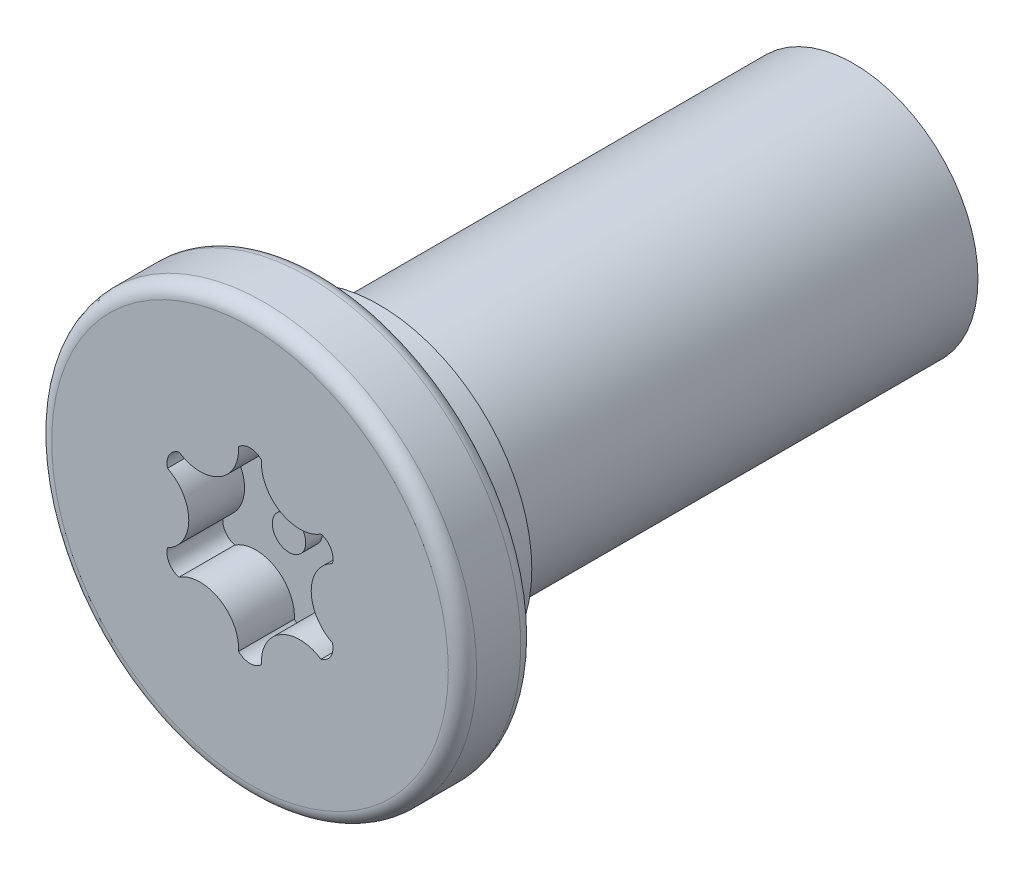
ISO-10303-21;
HEADER;
FILE_DESCRIPTION(('STEP AP214'),'2;1');
FILE_NAME('part.step','',(''),(''),'','','');
FILE_SCHEMA(('AUTOMOTIVE_DESIGN { 1 0 10303 214 1 1 1 1 }'));
ENDSEC;
DATA;
#1=APPLICATION_CONTEXT('core data for automotive mechanical design processes');
#2=APPLICATION_PROTOCOL_DEFINITION('international standard','automotive_design',2000,#1);
#3=PRODUCT_CONTEXT('',#1,'mechanical');
#4=PRODUCT('Part','Part','',(#3));
#5=PRODUCT_RELATED_PRODUCT_CATEGORY('part','',(#4));
#6=PRODUCT_DEFINITION_FORMATION('','',#4);
#7=PRODUCT_DEFINITION_CONTEXT('part definition',#1,'design');
#8=PRODUCT_DEFINITION('design','',#6,#7);
#9=PRODUCT_DEFINITION_SHAPE('','',#8);
#10=(LENGTH_UNIT() NAMED_UNIT(*) SI_UNIT(.MILLI.,.METRE.));
#11=(NAMED_UNIT(*) PLANE_ANGLE_UNIT() SI_UNIT($,.RADIAN.));
#12=(NAMED_UNIT(*) SI_UNIT($,.STERADIAN.) SOLID_ANGLE_UNIT());
#13=UNCERTAINTY_MEASURE_WITH_UNIT(LENGTH_MEASURE(1.E-05),#10,'distance_accuracy_value','');
#14=(GEOMETRIC_REPRESENTATION_CONTEXT(3) GLOBAL_UNCERTAINTY_ASSIGNED_CONTEXT((#13)) GLOBAL_UNIT_ASSIGNED_CONTEXT((#10,
#11,#12)) REPRESENTATION_CONTEXT('',''));
#15=CARTESIAN_POINT('',(0.,0.,0.));
#16=DIRECTION('',(0.,0.,1.));
#17=DIRECTION('',(1.,0.,0.));
#18=AXIS2_PLACEMENT_3D('',#15,#16,#17);
#19=CARTESIAN_POINT('',(0.,0.,0.));
#20=DIRECTION('',(0.,0.,1.));
#21=DIRECTION('',(1.,0.,0.));
#22=AXIS2_PLACEMENT_3D('',#19,#20,#21);
#23=PLANE('',#22);
#24=CARTESIAN_POINT('',(0.,0.,0.));
#25=DIRECTION('',(0.,0.,1.));
#26=DIRECTION('',(1.,0.,0.));
#27=AXIS2_PLACEMENT_3D('',#24,#25,#26);
#28=CIRCLE('',#27,3.55599999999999);
#29=CARTESIAN_POINT('',(3.55599999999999,0.,0.));
#30=VERTEX_POINT('',#29);
#31=EDGE_CURVE('E54',#30,#30,#28,.T.);
#32=ORIENTED_EDGE('',*,*,#31,.T.);
#33=EDGE_LOOP('',(#32));
#34=FACE_BOUND('',#33,.T.);
#35=CARTESIAN_POINT('',(0.893828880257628,1.54815703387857,0.));
#36=DIRECTION('',(0.,0.,1.));
#37=DIRECTION('',(1.,0.,0.));
#38=AXIS2_PLACEMENT_3D('',#35,#36,#37);
#39=CIRCLE('',#38,0.69);
#40=CARTESIAN_POINT('',(0.205060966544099,1.58937306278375,0.));
#41=VERTEX_POINT('',#40);
#42=CARTESIAN_POINT('',(1.27390696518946,0.972274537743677,0.));
#43=VERTEX_POINT('',#42);
#44=EDGE_CURVE('E181',#41,#43,#39,.T.);
#45=ORIENTED_EDGE('',*,*,#44,.T.);
#46=CARTESIAN_POINT('',(1.19884944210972,0.692156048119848,0.));
#47=DIRECTION('',(0.,0.,1.));
#48=DIRECTION('',(1.,0.,0.));
#49=AXIS2_PLACEMENT_3D('',#46,#47,#48);
#50=CIRCLE('',#49,0.29);
#51=CARTESIAN_POINT('',(1.47896793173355,0.617098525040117,0.));
#52=VERTEX_POINT('',#51);
#53=EDGE_CURVE('E61',#43,#52,#50,.F.);
#54=ORIENTED_EDGE('',*,*,#53,.T.);
#55=CARTESIAN_POINT('',(1.78765776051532,0.,0.));
#56=DIRECTION('',(0.,0.,1.));
#57=DIRECTION('',(1.,0.,0.));
#58=AXIS2_PLACEMENT_3D('',#55,#56,#57);
#59=CIRCLE('',#58,0.69);
#60=CARTESIAN_POINT('',(1.47896793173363,-0.617098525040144,0.));
#61=VERTEX_POINT('',#60);
#62=EDGE_CURVE('E111',#52,#61,#59,.T.);
#63=ORIENTED_EDGE('',*,*,#62,.T.);
#64=CARTESIAN_POINT('',(1.1988494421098,-0.692156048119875,0.));
#65=DIRECTION('',(0.,0.,1.));
#66=DIRECTION('',(1.,0.,0.));
#67=AXIS2_PLACEMENT_3D('',#64,#65,#66);
#68=CIRCLE('',#67,0.29);
#69=CARTESIAN_POINT('',(1.27390696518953,-0.972274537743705,0.));
#70=VERTEX_POINT('',#69);
#71=EDGE_CURVE('E216',#61,#70,#68,.F.);
#72=ORIENTED_EDGE('',*,*,#71,.T.);
#73=CARTESIAN_POINT('',(0.893828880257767,-1.54815703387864,0.));
#74=DIRECTION('',(0.,0.,1.));
#75=DIRECTION('',(1.,0.,0.));
#76=AXIS2_PLACEMENT_3D('',#73,#74,#75);
#77=CIRCLE('',#76,0.69);
#78=CARTESIAN_POINT('',(0.205060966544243,-1.5893730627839,0.));
#79=VERTEX_POINT('',#78);
#80=EDGE_CURVE('E160',#70,#79,#77,.T.);
#81=ORIENTED_EDGE('',*,*,#80,.T.);
#82=CARTESIAN_POINT('',(1.43067375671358E-13,-1.3843120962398,0.));
#83=DIRECTION('',(0.,0.,1.));
#84=DIRECTION('',(1.,0.,0.));
#85=AXIS2_PLACEMENT_3D('',#82,#83,#84);
#86=CIRCLE('',#85,0.29);
#87=CARTESIAN_POINT('',(-0.205060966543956,-1.5893730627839,0.));
#88=VERTEX_POINT('',#87);
#89=EDGE_CURVE('E210',#79,#88,#86,.F.);
#90=ORIENTED_EDGE('',*,*,#89,.T.);
#91=CARTESIAN_POINT('',(-0.893828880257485,-1.54815703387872,0.));
#92=DIRECTION('',(0.,0.,1.));
#93=DIRECTION('',(1.,0.,0.));
#94=AXIS2_PLACEMENT_3D('',#91,#92,#93);
#95=CIRCLE('',#94,0.69);
#96=CARTESIAN_POINT('',(-1.27390696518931,-0.97227453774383,0.));
#97=VERTEX_POINT('',#96);
#98=EDGE_CURVE('E206',#88,#97,#95,.T.);
#99=ORIENTED_EDGE('',*,*,#98,.T.);
#100=CARTESIAN_POINT('',(-1.19884944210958,-0.69215604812,0.));
#101=DIRECTION('',(0.,0.,1.));
#102=DIRECTION('',(1.,0.,0.));
#103=AXIS2_PLACEMENT_3D('',#100,#101,#102);
#104=CIRCLE('',#103,0.29);
#105=CARTESIAN_POINT('',(-1.47896793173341,-0.617098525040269,0.));
#106=VERTEX_POINT('',#105);
#107=EDGE_CURVE('E202',#97,#106,#104,.F.);
#108=ORIENTED_EDGE('',*,*,#107,.T.);
#109=CARTESIAN_POINT('',(-1.78765776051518,-1.56674837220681E-13,0.));
#110=DIRECTION('',(0.,0.,1.));
#111=DIRECTION('',(1.,0.,0.));
#112=AXIS2_PLACEMENT_3D('',#109,#110,#111);
#113=CIRCLE('',#112,0.69);
#114=CARTESIAN_POINT('',(-1.47896793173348,0.617098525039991,0.));
#115=VERTEX_POINT('',#114);
#116=EDGE_CURVE('E198',#106,#115,#113,.T.);
#117=ORIENTED_EDGE('',*,*,#116,.T.);
#118=CARTESIAN_POINT('',(-1.19884944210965,0.692156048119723,0.));
#119=DIRECTION('',(0.,0.,1.));
#120=DIRECTION('',(1.,0.,0.));
#121=AXIS2_PLACEMENT_3D('',#118,#119,#120);
#122=CIRCLE('',#121,0.29);
#123=CARTESIAN_POINT('',(-1.27390696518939,0.972274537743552,0.));
#124=VERTEX_POINT('',#123);
#125=EDGE_CURVE('E194',#115,#124,#122,.F.);
#126=ORIENTED_EDGE('',*,*,#125,.T.);
#127=CARTESIAN_POINT('',(-0.893828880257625,1.54815703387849,0.));
#128=DIRECTION('',(0.,0.,1.));
#129=DIRECTION('',(1.,0.,0.));
#130=AXIS2_PLACEMENT_3D('',#127,#128,#129);
#131=CIRCLE('',#130,0.690000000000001);
#132=CARTESIAN_POINT('',(-0.205060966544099,1.58937306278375,0.));
#133=VERTEX_POINT('',#132);
#134=EDGE_CURVE('E190',#124,#133,#131,.T.);
#135=ORIENTED_EDGE('',*,*,#134,.T.);
#136=CARTESIAN_POINT('',(0.,1.38431209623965,0.));
#137=DIRECTION('',(0.,0.,1.));
#138=DIRECTION('',(1.,0.,0.));
#139=AXIS2_PLACEMENT_3D('',#136,#137,#138);
#140=CIRCLE('',#139,0.29);
#141=EDGE_CURVE('E186',#133,#41,#140,.F.);
#142=ORIENTED_EDGE('',*,*,#141,.T.);
#143=EDGE_LOOP('',(#45,#54,#63,#72,#81,#90,#99,#108,#117,#126,#135,#142));
#144=FACE_BOUND('',#143,.T.);
#145=ADVANCED_FACE('F45',(#34,#144),#23,.T.);
#146=CARTESIAN_POINT('',(0.,0.,-1.3));
#147=DIRECTION('',(0.,0.,1.));
#148=DIRECTION('',(1.,0.,0.));
#149=AXIS2_PLACEMENT_3D('',#146,#147,#148);
#150=PLANE('',#149);
#151=CARTESIAN_POINT('',(0.,0.,-1.3));
#152=DIRECTION('',(0.,0.,1.));
#153=DIRECTION('',(1.,0.,0.));
#154=AXIS2_PLACEMENT_3D('',#151,#152,#153);
#155=CIRCLE('',#154,2.738000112);
#156=CARTESIAN_POINT('',(2.738000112,0.,-1.3));
#157=VERTEX_POINT('',#156);
#158=EDGE_CURVE('E11',#157,#157,#155,.F.);
#159=ORIENTED_EDGE('',*,*,#158,.F.);
#160=EDGE_LOOP('',(#159));
#161=FACE_BOUND('',#160,.T.);
#162=CARTESIAN_POINT('',(0.,0.,-1.3));
#163=DIRECTION('',(0.,0.,1.));
#164=DIRECTION('',(1.,0.,0.));
#165=AXIS2_PLACEMENT_3D('',#162,#163,#164);
#166=CIRCLE('',#165,3.55599999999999);
#167=CARTESIAN_POINT('',(3.55599999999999,0.,-1.3));
#168=VERTEX_POINT('',#167);
#169=EDGE_CURVE('E260',#168,#168,#166,.F.);
#170=ORIENTED_EDGE('',*,*,#169,.T.);
#171=EDGE_LOOP('',(#170));
#172=FACE_BOUND('',#171,.T.);
#173=ADVANCED_FACE('F283',(#161,#172),#150,.F.);
#174=CARTESIAN_POINT('',(0.,0.,-1.3));
#175=DIRECTION('',(0.,0.,1.));
#176=DIRECTION('',(1.,0.,0.));
#177=AXIS2_PLACEMENT_3D('',#174,#175,#176);
#178=CYLINDRICAL_SURFACE('',#177,3.80999999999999);
#179=CARTESIAN_POINT('',(0.,0.,-1.046));
#180=DIRECTION('',(0.,0.,1.));
#181=DIRECTION('',(1.,0.,0.));
#182=AXIS2_PLACEMENT_3D('',#179,#180,#181);
#183=CIRCLE('',#182,3.80999999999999);
#184=CARTESIAN_POINT('',(3.80999999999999,0.,-1.046));
#185=VERTEX_POINT('',#184);
#186=EDGE_CURVE('E256',#185,#185,#183,.T.);
#187=ORIENTED_EDGE('',*,*,#186,.T.);
#188=EDGE_LOOP('',(#187));
#189=FACE_BOUND('',#188,.T.);
#190=CARTESIAN_POINT('',(0.,0.,-0.254));
#191=DIRECTION('',(0.,0.,1.));
#192=DIRECTION('',(1.,0.,0.));
#193=AXIS2_PLACEMENT_3D('',#190,#191,#192);
#194=CIRCLE('',#193,3.80999999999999);
#195=CARTESIAN_POINT('',(3.80999999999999,0.,-0.254));
#196=VERTEX_POINT('',#195);
#197=EDGE_CURVE('E225',#196,#196,#194,.F.);
#198=ORIENTED_EDGE('',*,*,#197,.T.);
#199=EDGE_LOOP('',(#198));
#200=FACE_BOUND('',#199,.T.);
#201=ADVANCED_FACE('F289',(#189,#200),#178,.T.);
#202=CARTESIAN_POINT('',(1.19884944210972,0.692156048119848,-1.));
#203=DIRECTION('',(0.,0.,1.));
#204=DIRECTION('',(1.,0.,0.));
#205=AXIS2_PLACEMENT_3D('',#202,#203,#204);
#206=CYLINDRICAL_SURFACE('',#205,0.29);
#207=ORIENTED_EDGE('',*,*,#53,.F.);
#208=DIRECTION('',(0.,0.,1.));
#209=VECTOR('',#208,1.);
#210=CARTESIAN_POINT('',(1.27390696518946,0.972274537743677,-1.));
#211=LINE('',#210,#209);
#212=CARTESIAN_POINT('',(1.27390696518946,0.972274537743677,-1.));
#213=VERTEX_POINT('',#212);
#214=EDGE_CURVE('E178',#213,#43,#211,.T.);
#215=ORIENTED_EDGE('',*,*,#214,.F.);
#216=CARTESIAN_POINT('',(1.19884944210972,0.692156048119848,-1.));
#217=DIRECTION('',(0.,0.,1.));
#218=DIRECTION('',(1.,0.,0.));
#219=AXIS2_PLACEMENT_3D('',#216,#217,#218);
#220=CIRCLE('',#219,0.29);
#221=CARTESIAN_POINT('',(1.47896793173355,0.617098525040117,-1.));
#222=VERTEX_POINT('',#221);
#223=EDGE_CURVE('E221',#213,#222,#220,.F.);
#224=ORIENTED_EDGE('',*,*,#223,.T.);
#225=DIRECTION('',(0.,0.,1.));
#226=VECTOR('',#225,1.);
#227=CARTESIAN_POINT('',(1.47896793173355,0.617098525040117,-1.));
#228=LINE('',#227,#226);
#229=EDGE_CURVE('E222',#222,#52,#228,.T.);
#230=ORIENTED_EDGE('',*,*,#229,.T.);
#231=EDGE_LOOP('',(#207,#215,#224,#230));
#232=FACE_BOUND('',#231,.T.);
#233=ADVANCED_FACE('F294',(#232),#206,.F.);
#234=CARTESIAN_POINT('',(1.78765776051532,0.,-1.));
#235=DIRECTION('',(0.,0.,1.));
#236=DIRECTION('',(1.,0.,0.));
#237=AXIS2_PLACEMENT_3D('',#234,#235,#236);
#238=CYLINDRICAL_SURFACE('',#237,0.69);
#239=ORIENTED_EDGE('',*,*,#62,.F.);
#240=ORIENTED_EDGE('',*,*,#229,.F.);
#241=CARTESIAN_POINT('',(1.78765776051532,0.,-1.));
#242=DIRECTION('',(0.,0.,1.));
#243=DIRECTION('',(1.,0.,0.));
#244=AXIS2_PLACEMENT_3D('',#241,#242,#243);
#245=CIRCLE('',#244,0.69);
#246=CARTESIAN_POINT('',(1.47896793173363,-0.617098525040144,-1.));
#247=VERTEX_POINT('',#246);
#248=EDGE_CURVE('E70',#222,#247,#245,.T.);
#249=ORIENTED_EDGE('',*,*,#248,.T.);
#250=DIRECTION('',(0.,0.,1.));
#251=VECTOR('',#250,1.);
#252=CARTESIAN_POINT('',(1.47896793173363,-0.617098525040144,-1.));
#253=LINE('',#252,#251);
#254=EDGE_CURVE('E151',#247,#61,#253,.T.);
#255=ORIENTED_EDGE('',*,*,#254,.T.);
#256=EDGE_LOOP('',(#239,#240,#249,#255));
#257=FACE_BOUND('',#256,.T.);
#258=ADVANCED_FACE('F301',(#257),#238,.T.);
#259=CARTESIAN_POINT('',(1.1988494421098,-0.692156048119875,-1.));
#260=DIRECTION('',(0.,0.,1.));
#261=DIRECTION('',(1.,0.,0.));
#262=AXIS2_PLACEMENT_3D('',#259,#260,#261);
#263=CYLINDRICAL_SURFACE('',#262,0.29);
#264=ORIENTED_EDGE('',*,*,#71,.F.);
#265=ORIENTED_EDGE('',*,*,#254,.F.);
#266=CARTESIAN_POINT('',(1.1988494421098,-0.692156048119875,-1.));
#267=DIRECTION('',(0.,0.,1.));
#268=DIRECTION('',(1.,0.,0.));
#269=AXIS2_PLACEMENT_3D('',#266,#267,#268);
#270=CIRCLE('',#269,0.29);
#271=CARTESIAN_POINT('',(1.27390696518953,-0.972274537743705,-1.));
#272=VERTEX_POINT('',#271);
#273=EDGE_CURVE('E145',#247,#272,#270,.F.);
#274=ORIENTED_EDGE('',*,*,#273,.T.);
#275=DIRECTION('',(0.,0.,1.));
#276=VECTOR('',#275,1.);
#277=CARTESIAN_POINT('',(1.27390696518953,-0.972274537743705,-1.));
#278=LINE('',#277,#276);
#279=EDGE_CURVE('E149',#272,#70,#278,.T.);
#280=ORIENTED_EDGE('',*,*,#279,.T.);
#281=EDGE_LOOP('',(#264,#265,#274,#280));
#282=FACE_BOUND('',#281,.T.);
#283=ADVANCED_FACE('F148',(#282),#263,.F.);
#284=CARTESIAN_POINT('',(0.893828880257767,-1.54815703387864,-1.));
#285=DIRECTION('',(0.,0.,1.));
#286=DIRECTION('',(1.,0.,0.));
#287=AXIS2_PLACEMENT_3D('',#284,#285,#286);
#288=CYLINDRICAL_SURFACE('',#287,0.69);
#289=ORIENTED_EDGE('',*,*,#80,.F.);
#290=ORIENTED_EDGE('',*,*,#279,.F.);
#291=CARTESIAN_POINT('',(0.893828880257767,-1.54815703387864,-1.));
#292=DIRECTION('',(0.,0.,1.));
#293=DIRECTION('',(1.,0.,0.));
#294=AXIS2_PLACEMENT_3D('',#291,#292,#293);
#295=CIRCLE('',#294,0.69);
#296=CARTESIAN_POINT('',(0.205060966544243,-1.5893730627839,-1.));
#297=VERTEX_POINT('',#296);
#298=EDGE_CURVE('E154',#272,#297,#295,.T.);
#299=ORIENTED_EDGE('',*,*,#298,.T.);
#300=DIRECTION('',(0.,0.,1.));
#301=VECTOR('',#300,1.);
#302=CARTESIAN_POINT('',(0.205060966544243,-1.5893730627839,-1.));
#303=LINE('',#302,#301);
#304=EDGE_CURVE('E163',#297,#79,#303,.T.);
#305=ORIENTED_EDGE('',*,*,#304,.T.);
#306=EDGE_LOOP('',(#289,#290,#299,#305));
#307=FACE_BOUND('',#306,.T.);
#308=ADVANCED_FACE('F157',(#307),#288,.T.);
#309=CARTESIAN_POINT('',(1.43067375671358E-13,-1.3843120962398,-1.));
#310=DIRECTION('',(0.,0.,1.));
#311=DIRECTION('',(1.,0.,0.));
#312=AXIS2_PLACEMENT_3D('',#309,#310,#311);
#313=CYLINDRICAL_SURFACE('',#312,0.29);
#314=ORIENTED_EDGE('',*,*,#89,.F.);
#315=ORIENTED_EDGE('',*,*,#304,.F.);
#316=CARTESIAN_POINT('',(1.43067375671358E-13,-1.3843120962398,-1.));
#317=DIRECTION('',(0.,0.,1.));
#318=DIRECTION('',(1.,0.,0.));
#319=AXIS2_PLACEMENT_3D('',#316,#317,#318);
#320=CIRCLE('',#319,0.29);
#321=CARTESIAN_POINT('',(-0.205060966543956,-1.5893730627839,-1.));
#322=VERTEX_POINT('',#321);
#323=EDGE_CURVE('E168',#297,#322,#320,.F.);
#324=ORIENTED_EDGE('',*,*,#323,.T.);
#325=DIRECTION('',(0.,0.,1.));
#326=VECTOR('',#325,1.);
#327=CARTESIAN_POINT('',(-0.205060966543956,-1.5893730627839,-1.));
#328=LINE('',#327,#326);
#329=EDGE_CURVE('E230',#322,#88,#328,.T.);
#330=ORIENTED_EDGE('',*,*,#329,.T.);
#331=EDGE_LOOP('',(#314,#315,#324,#330));
#332=FACE_BOUND('',#331,.T.);
#333=ADVANCED_FACE('F318',(#332),#313,.F.);
#334=CARTESIAN_POINT('',(-0.893828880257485,-1.54815703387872,-1.));
#335=DIRECTION('',(0.,0.,1.));
#336=DIRECTION('',(1.,0.,0.));
#337=AXIS2_PLACEMENT_3D('',#334,#335,#336);
#338=CYLINDRICAL_SURFACE('',#337,0.69);
#339=ORIENTED_EDGE('',*,*,#98,.F.);
#340=ORIENTED_EDGE('',*,*,#329,.F.);
#341=CARTESIAN_POINT('',(-0.893828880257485,-1.54815703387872,-1.));
#342=DIRECTION('',(0.,0.,1.));
#343=DIRECTION('',(1.,0.,0.));
#344=AXIS2_PLACEMENT_3D('',#341,#342,#343);
#345=CIRCLE('',#344,0.69);
#346=CARTESIAN_POINT('',(-1.27390696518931,-0.97227453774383,-1.));
#347=VERTEX_POINT('',#346);
#348=EDGE_CURVE('E172',#322,#347,#345,.T.);
#349=ORIENTED_EDGE('',*,*,#348,.T.);
#350=DIRECTION('',(0.,0.,1.));
#351=VECTOR('',#350,1.);
#352=CARTESIAN_POINT('',(-1.27390696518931,-0.97227453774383,-1.));
#353=LINE('',#352,#351);
#354=EDGE_CURVE('E233',#347,#97,#353,.T.);
#355=ORIENTED_EDGE('',*,*,#354,.T.);
#356=EDGE_LOOP('',(#339,#340,#349,#355));
#357=FACE_BOUND('',#356,.T.);
#358=ADVANCED_FACE('F321',(#357),#338,.T.);
#359=CARTESIAN_POINT('',(-1.19884944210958,-0.69215604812,-1.));
#360=DIRECTION('',(0.,0.,1.));
#361=DIRECTION('',(1.,0.,0.));
#362=AXIS2_PLACEMENT_3D('',#359,#360,#361);
#363=CYLINDRICAL_SURFACE('',#362,0.29);
#364=ORIENTED_EDGE('',*,*,#107,.F.);
#365=ORIENTED_EDGE('',*,*,#354,.F.);
#366=CARTESIAN_POINT('',(-1.19884944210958,-0.69215604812,-1.));
#367=DIRECTION('',(0.,0.,1.));
#368=DIRECTION('',(1.,0.,0.));
#369=AXIS2_PLACEMENT_3D('',#366,#367,#368);
#370=CIRCLE('',#369,0.29);
#371=CARTESIAN_POINT('',(-1.47896793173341,-0.617098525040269,-1.));
#372=VERTEX_POINT('',#371);
#373=EDGE_CURVE('E374',#347,#372,#370,.F.);
#374=ORIENTED_EDGE('',*,*,#373,.T.);
#375=DIRECTION('',(0.,0.,1.));
#376=VECTOR('',#375,1.);
#377=CARTESIAN_POINT('',(-1.47896793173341,-0.617098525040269,-1.));
#378=LINE('',#377,#376);
#379=EDGE_CURVE('E236',#372,#106,#378,.T.);
#380=ORIENTED_EDGE('',*,*,#379,.T.);
#381=EDGE_LOOP('',(#364,#365,#374,#380));
#382=FACE_BOUND('',#381,.T.);
#383=ADVANCED_FACE('F325',(#382),#363,.F.);
#384=CARTESIAN_POINT('',(-1.78765776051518,-1.56674837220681E-13,-1.));
#385=DIRECTION('',(0.,0.,1.));
#386=DIRECTION('',(1.,0.,0.));
#387=AXIS2_PLACEMENT_3D('',#384,#385,#386);
#388=CYLINDRICAL_SURFACE('',#387,0.69);
#389=ORIENTED_EDGE('',*,*,#116,.F.);
#390=ORIENTED_EDGE('',*,*,#379,.F.);
#391=CARTESIAN_POINT('',(-1.78765776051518,-1.56674837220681E-13,-1.));
#392=DIRECTION('',(0.,0.,1.));
#393=DIRECTION('',(1.,0.,0.));
#394=AXIS2_PLACEMENT_3D('',#391,#392,#393);
#395=CIRCLE('',#394,0.69);
#396=CARTESIAN_POINT('',(-1.47896793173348,0.617098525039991,-1.));
#397=VERTEX_POINT('',#396);
#398=EDGE_CURVE('E371',#372,#397,#395,.T.);
#399=ORIENTED_EDGE('',*,*,#398,.T.);
#400=DIRECTION('',(0.,0.,1.));
#401=VECTOR('',#400,1.);
#402=CARTESIAN_POINT('',(-1.47896793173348,0.617098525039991,-1.));
#403=LINE('',#402,#401);
#404=EDGE_CURVE('E239',#397,#115,#403,.T.);
#405=ORIENTED_EDGE('',*,*,#404,.T.);
#406=EDGE_LOOP('',(#389,#390,#399,#405));
#407=FACE_BOUND('',#406,.T.);
#408=ADVANCED_FACE('F329',(#407),#388,.T.);
#409=CARTESIAN_POINT('',(-1.19884944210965,0.692156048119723,-1.));
#410=DIRECTION('',(0.,0.,1.));
#411=DIRECTION('',(1.,0.,0.));
#412=AXIS2_PLACEMENT_3D('',#409,#410,#411);
#413=CYLINDRICAL_SURFACE('',#412,0.29);
#414=ORIENTED_EDGE('',*,*,#125,.F.);
#415=ORIENTED_EDGE('',*,*,#404,.F.);
#416=CARTESIAN_POINT('',(-1.19884944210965,0.692156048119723,-1.));
#417=DIRECTION('',(0.,0.,1.));
#418=DIRECTION('',(1.,0.,0.));
#419=AXIS2_PLACEMENT_3D('',#416,#417,#418);
#420=CIRCLE('',#419,0.29);
#421=CARTESIAN_POINT('',(-1.27390696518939,0.972274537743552,-1.));
#422=VERTEX_POINT('',#421);
#423=EDGE_CURVE('E364',#397,#422,#420,.F.);
#424=ORIENTED_EDGE('',*,*,#423,.T.);
#425=DIRECTION('',(0.,0.,1.));
#426=VECTOR('',#425,1.);
#427=CARTESIAN_POINT('',(-1.27390696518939,0.972274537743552,-1.));
#428=LINE('',#427,#426);
#429=EDGE_CURVE('E242',#422,#124,#428,.T.);
#430=ORIENTED_EDGE('',*,*,#429,.T.);
#431=EDGE_LOOP('',(#414,#415,#424,#430));
#432=FACE_BOUND('',#431,.T.);
#433=ADVANCED_FACE('F333',(#432),#413,.F.);
#434=CARTESIAN_POINT('',(-0.893828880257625,1.54815703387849,-1.));
#435=DIRECTION('',(0.,0.,1.));
#436=DIRECTION('',(1.,0.,0.));
#437=AXIS2_PLACEMENT_3D('',#434,#435,#436);
#438=CYLINDRICAL_SURFACE('',#437,0.690000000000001);
#439=ORIENTED_EDGE('',*,*,#134,.F.);
#440=ORIENTED_EDGE('',*,*,#429,.F.);
#441=CARTESIAN_POINT('',(-0.893828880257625,1.54815703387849,-1.));
#442=DIRECTION('',(0.,0.,1.));
#443=DIRECTION('',(1.,0.,0.));
#444=AXIS2_PLACEMENT_3D('',#441,#442,#443);
#445=CIRCLE('',#444,0.690000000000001);
#446=CARTESIAN_POINT('',(-0.205060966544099,1.58937306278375,-1.));
#447=VERTEX_POINT('',#446);
#448=EDGE_CURVE('E360',#422,#447,#445,.T.);
#449=ORIENTED_EDGE('',*,*,#448,.T.);
#450=DIRECTION('',(0.,0.,1.));
#451=VECTOR('',#450,1.);
#452=CARTESIAN_POINT('',(-0.205060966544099,1.58937306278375,-1.));
#453=LINE('',#452,#451);
#454=EDGE_CURVE('E245',#447,#133,#453,.T.);
#455=ORIENTED_EDGE('',*,*,#454,.T.);
#456=EDGE_LOOP('',(#439,#440,#449,#455));
#457=FACE_BOUND('',#456,.T.);
#458=ADVANCED_FACE('F337',(#457),#438,.T.);
#459=CARTESIAN_POINT('',(0.,1.38431209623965,-1.));
#460=DIRECTION('',(0.,0.,1.));
#461=DIRECTION('',(1.,0.,0.));
#462=AXIS2_PLACEMENT_3D('',#459,#460,#461);
#463=CYLINDRICAL_SURFACE('',#462,0.29);
#464=ORIENTED_EDGE('',*,*,#141,.F.);
#465=ORIENTED_EDGE('',*,*,#454,.F.);
#466=CARTESIAN_POINT('',(0.,1.38431209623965,-1.));
#467=DIRECTION('',(0.,0.,1.));
#468=DIRECTION('',(1.,0.,0.));
#469=AXIS2_PLACEMENT_3D('',#466,#467,#468);
#470=CIRCLE('',#469,0.29);
#471=CARTESIAN_POINT('',(0.205060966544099,1.58937306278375,-1.));
#472=VERTEX_POINT('',#471);
#473=EDGE_CURVE('E357',#447,#472,#470,.F.);
#474=ORIENTED_EDGE('',*,*,#473,.T.);
#475=DIRECTION('',(0.,0.,1.));
#476=VECTOR('',#475,1.);
#477=CARTESIAN_POINT('',(0.205060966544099,1.58937306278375,-1.));
#478=LINE('',#477,#476);
#479=EDGE_CURVE('E248',#472,#41,#478,.T.);
#480=ORIENTED_EDGE('',*,*,#479,.T.);
#481=EDGE_LOOP('',(#464,#465,#474,#480));
#482=FACE_BOUND('',#481,.T.);
#483=ADVANCED_FACE('F341',(#482),#463,.F.);
#484=CARTESIAN_POINT('',(0.893828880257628,1.54815703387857,-1.));
#485=DIRECTION('',(0.,0.,1.));
#486=DIRECTION('',(1.,0.,0.));
#487=AXIS2_PLACEMENT_3D('',#484,#485,#486);
#488=CYLINDRICAL_SURFACE('',#487,0.69);
#489=ORIENTED_EDGE('',*,*,#44,.F.);
#490=ORIENTED_EDGE('',*,*,#479,.F.);
#491=CARTESIAN_POINT('',(0.893828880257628,1.54815703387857,-1.));
#492=DIRECTION('',(0.,0.,1.));
#493=DIRECTION('',(1.,0.,0.));
#494=AXIS2_PLACEMENT_3D('',#491,#492,#493);
#495=CIRCLE('',#494,0.69);
#496=EDGE_CURVE('E118',#472,#213,#495,.T.);
#497=ORIENTED_EDGE('',*,*,#496,.T.);
#498=ORIENTED_EDGE('',*,*,#214,.T.);
#499=EDGE_LOOP('',(#489,#490,#497,#498));
#500=FACE_BOUND('',#499,.T.);
#501=ADVANCED_FACE('F344',(#500),#488,.T.);
#502=CARTESIAN_POINT('',(0.,0.,-1.));
#503=DIRECTION('',(0.,0.,1.));
#504=DIRECTION('',(1.,0.,0.));
#505=AXIS2_PLACEMENT_3D('',#502,#503,#504);
#506=PLANE('',#505);
#507=CARTESIAN_POINT('',(0.,0.,-1.));
#508=DIRECTION('',(0.,0.,1.));
#509=DIRECTION('',(1.,0.,0.));
#510=AXIS2_PLACEMENT_3D('',#507,#508,#509);
#511=CIRCLE('',#510,0.3);
#512=CARTESIAN_POINT('',(0.3,0.,-1.));
#513=VERTEX_POINT('',#512);
#514=EDGE_CURVE('E396',#513,#513,#511,.T.);
#515=ORIENTED_EDGE('',*,*,#514,.F.);
#516=EDGE_LOOP('',(#515));
#517=FACE_BOUND('',#516,.T.);
#518=ORIENTED_EDGE('',*,*,#223,.F.);
#519=ORIENTED_EDGE('',*,*,#496,.F.);
#520=ORIENTED_EDGE('',*,*,#473,.F.);
#521=ORIENTED_EDGE('',*,*,#448,.F.);
#522=ORIENTED_EDGE('',*,*,#423,.F.);
#523=ORIENTED_EDGE('',*,*,#398,.F.);
#524=ORIENTED_EDGE('',*,*,#373,.F.);
#525=ORIENTED_EDGE('',*,*,#348,.F.);
#526=ORIENTED_EDGE('',*,*,#323,.F.);
#527=ORIENTED_EDGE('',*,*,#298,.F.);
#528=ORIENTED_EDGE('',*,*,#273,.F.);
#529=ORIENTED_EDGE('',*,*,#248,.F.);
#530=EDGE_LOOP('',(#518,#519,#520,#521,#522,#523,#524,#525,#526,#527,#528,#529));
#531=FACE_BOUND('',#530,.T.);
#532=ADVANCED_FACE('F166',(#517,#531),#506,.T.);
#533=CARTESIAN_POINT('',(0.,0.,-1.046));
#534=DIRECTION('',(0.,0.,1.));
#535=DIRECTION('',(1.,0.,0.));
#536=AXIS2_PLACEMENT_3D('',#533,#534,#535);
#537=TOROIDAL_SURFACE('',#536,3.55599999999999,0.254);
#538=ORIENTED_EDGE('',*,*,#169,.F.);
#539=EDGE_LOOP('',(#538));
#540=FACE_BOUND('',#539,.T.);
#541=ORIENTED_EDGE('',*,*,#186,.F.);
#542=EDGE_LOOP('',(#541));
#543=FACE_BOUND('',#542,.T.);
#544=ADVANCED_FACE('F271',(#540,#543),#537,.T.);
#545=CARTESIAN_POINT('',(0.,0.,-0.254));
#546=DIRECTION('',(0.,0.,1.));
#547=DIRECTION('',(1.,0.,0.));
#548=AXIS2_PLACEMENT_3D('',#545,#546,#547);
#549=TOROIDAL_SURFACE('',#548,3.55599999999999,0.254);
#550=ORIENTED_EDGE('',*,*,#197,.F.);
#551=EDGE_LOOP('',(#550));
#552=FACE_BOUND('',#551,.T.);
#553=ORIENTED_EDGE('',*,*,#31,.F.);
#554=EDGE_LOOP('',(#553));
#555=FACE_BOUND('',#554,.T.);
#556=ADVANCED_FACE('F47',(#552,#555),#549,.T.);
#557=CARTESIAN_POINT('',(0.,0.,-2.316));
#558=DIRECTION('',(0.,0.,-1.));
#559=DIRECTION('',(-1.,0.,0.));
#560=AXIS2_PLACEMENT_3D('',#557,#558,#559);
#561=PLANE('',#560);
#562=CARTESIAN_POINT('',(0.,0.,-2.316));
#563=DIRECTION('',(0.,0.,-1.));
#564=DIRECTION('',(-1.,0.,0.));
#565=AXIS2_PLACEMENT_3D('',#562,#563,#564);
#566=CIRCLE('',#565,2.738000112);
#567=CARTESIAN_POINT('',(-2.738000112,0.,-2.316));
#568=VERTEX_POINT('',#567);
#569=EDGE_CURVE('E182',#568,#568,#566,.T.);
#570=ORIENTED_EDGE('',*,*,#569,.T.);
#571=EDGE_LOOP('',(#570));
#572=FACE_BOUND('',#571,.T.);
#573=CARTESIAN_POINT('',(0.,0.,-2.316));
#574=DIRECTION('',(0.,0.,-1.));
#575=DIRECTION('',(-1.,0.,0.));
#576=AXIS2_PLACEMENT_3D('',#573,#574,#575);
#577=CIRCLE('',#576,2.230000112);
#578=CARTESIAN_POINT('',(2.230000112,0.,-2.316));
#579=VERTEX_POINT('',#578);
#580=EDGE_CURVE('E400',#579,#579,#577,.T.);
#581=ORIENTED_EDGE('',*,*,#580,.F.);
#582=EDGE_LOOP('',(#581));
#583=FACE_BOUND('',#582,.T.);
#584=ADVANCED_FACE('F270',(#572,#583),#561,.T.);
#585=CARTESIAN_POINT('',(0.,0.,-2.316));
#586=DIRECTION('',(0.,0.,1.));
#587=DIRECTION('',(1.,0.,0.));
#588=AXIS2_PLACEMENT_3D('',#585,#586,#587);
#589=CYLINDRICAL_SURFACE('',#588,2.738000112);
#590=ORIENTED_EDGE('',*,*,#569,.F.);
#591=EDGE_LOOP('',(#590));
#592=FACE_BOUND('',#591,.T.);
#593=ORIENTED_EDGE('',*,*,#158,.T.);
#594=EDGE_LOOP('',(#593));
#595=FACE_BOUND('',#594,.T.);
#596=ADVANCED_FACE('F277',(#592,#595),#589,.T.);
#597=CARTESIAN_POINT('',(0.,0.,-0.7));
#598=DIRECTION('',(0.,0.,-1.));
#599=DIRECTION('',(-1.,0.,0.));
#600=AXIS2_PLACEMENT_3D('',#597,#598,#599);
#601=CYLINDRICAL_SURFACE('',#600,0.3);
#602=CARTESIAN_POINT('',(0.,0.,-0.7));
#603=DIRECTION('',(0.,0.,1.));
#604=DIRECTION('',(1.,0.,0.));
#605=AXIS2_PLACEMENT_3D('',#602,#603,#604);
#606=CIRCLE('',#605,0.3);
#607=CARTESIAN_POINT('',(0.3,0.,-0.7));
#608=VERTEX_POINT('',#607);
#609=EDGE_CURVE('E395',#608,#608,#606,.T.);
#610=ORIENTED_EDGE('',*,*,#609,.F.);
#611=EDGE_LOOP('',(#610));
#612=FACE_BOUND('',#611,.T.);
#613=ORIENTED_EDGE('',*,*,#514,.T.);
#614=EDGE_LOOP('',(#613));
#615=FACE_BOUND('',#614,.T.);
#616=ADVANCED_FACE('F424',(#612,#615),#601,.T.);
#617=CARTESIAN_POINT('',(0.,0.,-0.7));
#618=DIRECTION('',(0.,0.,1.));
#619=DIRECTION('',(1.,0.,0.));
#620=AXIS2_PLACEMENT_3D('',#617,#618,#619);
#621=PLANE('',#620);
#622=ORIENTED_EDGE('',*,*,#609,.T.);
#623=EDGE_LOOP('',(#622));
#624=FACE_BOUND('',#623,.T.);
#625=ADVANCED_FACE('F416',(#624),#621,.T.);
#626=CARTESIAN_POINT('',(0.,0.,-10.825));
#627=DIRECTION('',(0.,0.,1.));
#628=DIRECTION('',(1.,0.,0.));
#629=AXIS2_PLACEMENT_3D('',#626,#627,#628);
#630=CYLINDRICAL_SURFACE('',#629,2.230000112);
#631=CARTESIAN_POINT('',(0.,0.,-10.825));
#632=DIRECTION('',(0.,0.,-1.));
#633=DIRECTION('',(-1.,0.,0.));
#634=AXIS2_PLACEMENT_3D('',#631,#632,#633);
#635=CIRCLE('',#634,2.230000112);
#636=CARTESIAN_POINT('',(2.230000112,0.,-10.825));
#637=VERTEX_POINT('',#636);
#638=EDGE_CURVE('E407',#637,#637,#635,.T.);
#639=CARTESIAN_POINT('',(2.230000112,0.,-2.316));
#640=CARTESIAN_POINT('',(2.230000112,0.,-2.40463541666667));
#641=CARTESIAN_POINT('',(2.230000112,0.,-2.49327083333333));
#642=CARTESIAN_POINT('',(2.230000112,0.,-2.67054166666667));
#643=CARTESIAN_POINT('',(2.230000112,0.,-2.75917708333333));
#644=CARTESIAN_POINT('',(2.230000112,0.,-2.93644791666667));
#645=CARTESIAN_POINT('',(2.230000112,0.,-3.02508333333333));
#646=CARTESIAN_POINT('',(2.230000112,0.,-3.20235416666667));
#647=CARTESIAN_POINT('',(2.230000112,0.,-3.29098958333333));
#648=CARTESIAN_POINT('',(2.230000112,0.,-3.46826041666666));
#649=CARTESIAN_POINT('',(2.230000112,0.,-3.55689583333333));
#650=CARTESIAN_POINT('',(2.230000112,0.,-3.73416666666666));
#651=CARTESIAN_POINT('',(2.230000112,0.,-3.82280208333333));
#652=CARTESIAN_POINT('',(2.230000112,0.,-4.00007291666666));
#653=CARTESIAN_POINT('',(2.230000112,0.,-4.08870833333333));
#654=CARTESIAN_POINT('',(2.230000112,0.,-4.26597916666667));
#655=CARTESIAN_POINT('',(2.230000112,0.,-4.35461458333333));
#656=CARTESIAN_POINT('',(2.230000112,0.,-4.53188541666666));
#657=CARTESIAN_POINT('',(2.230000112,0.,-4.62052083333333));
#658=CARTESIAN_POINT('',(2.230000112,0.,-4.79779166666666));
#659=CARTESIAN_POINT('',(2.230000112,0.,-4.88642708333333));
#660=CARTESIAN_POINT('',(2.230000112,0.,-5.06369791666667));
#661=CARTESIAN_POINT('',(2.230000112,0.,-5.15233333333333));
#662=CARTESIAN_POINT('',(2.230000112,0.,-5.32960416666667));
#663=CARTESIAN_POINT('',(2.230000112,0.,-5.41823958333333));
#664=CARTESIAN_POINT('',(2.230000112,0.,-5.59551041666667));
#665=CARTESIAN_POINT('',(2.230000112,0.,-5.68414583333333));
#666=CARTESIAN_POINT('',(2.230000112,0.,-5.86141666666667));
#667=CARTESIAN_POINT('',(2.230000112,0.,-5.95005208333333));
#668=CARTESIAN_POINT('',(2.230000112,0.,-6.12732291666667));
#669=CARTESIAN_POINT('',(2.230000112,0.,-6.21595833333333));
#670=CARTESIAN_POINT('',(2.230000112,0.,-6.39322916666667));
#671=CARTESIAN_POINT('',(2.230000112,0.,-6.48186458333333));
#672=CARTESIAN_POINT('',(2.230000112,0.,-6.65913541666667));
#673=CARTESIAN_POINT('',(2.230000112,0.,-6.74777083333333));
#674=CARTESIAN_POINT('',(2.230000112,0.,-6.92504166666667));
#675=CARTESIAN_POINT('',(2.230000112,0.,-7.01367708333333));
#676=CARTESIAN_POINT('',(2.230000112,0.,-7.19094791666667));
#677=CARTESIAN_POINT('',(2.230000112,0.,-7.27958333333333));
#678=CARTESIAN_POINT('',(2.230000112,0.,-7.45685416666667));
#679=CARTESIAN_POINT('',(2.230000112,0.,-7.54548958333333));
#680=CARTESIAN_POINT('',(2.230000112,0.,-7.72276041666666));
#681=CARTESIAN_POINT('',(2.230000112,0.,-7.81139583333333));
#682=CARTESIAN_POINT('',(2.230000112,0.,-7.98866666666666));
#683=CARTESIAN_POINT('',(2.230000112,0.,-8.07730208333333));
#684=CARTESIAN_POINT('',(2.230000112,0.,-8.25457291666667));
#685=CARTESIAN_POINT('',(2.230000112,0.,-8.34320833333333));
#686=CARTESIAN_POINT('',(2.230000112,0.,-8.52047916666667));
#687=CARTESIAN_POINT('',(2.230000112,0.,-8.60911458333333));
#688=CARTESIAN_POINT('',(2.230000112,0.,-8.78638541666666));
#689=CARTESIAN_POINT('',(2.230000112,0.,-8.87502083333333));
#690=CARTESIAN_POINT('',(2.230000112,0.,-9.05229166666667));
#691=CARTESIAN_POINT('',(2.230000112,0.,-9.14092708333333));
#692=CARTESIAN_POINT('',(2.230000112,0.,-9.31819791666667));
#693=CARTESIAN_POINT('',(2.230000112,0.,-9.40683333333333));
#694=CARTESIAN_POINT('',(2.230000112,0.,-9.58410416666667));
#695=CARTESIAN_POINT('',(2.230000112,0.,-9.67273958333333));
#696=CARTESIAN_POINT('',(2.230000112,0.,-9.85001041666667));
#697=CARTESIAN_POINT('',(2.230000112,0.,-9.93864583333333));
#698=CARTESIAN_POINT('',(2.230000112,0.,-10.1159166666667));
#699=CARTESIAN_POINT('',(2.230000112,0.,-10.2045520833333));
#700=CARTESIAN_POINT('',(2.230000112,0.,-10.3818229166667));
#701=CARTESIAN_POINT('',(2.230000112,0.,-10.4704583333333));
#702=CARTESIAN_POINT('',(2.230000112,0.,-10.6477291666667));
#703=CARTESIAN_POINT('',(2.230000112,0.,-10.7363645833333));
#704=CARTESIAN_POINT('',(2.230000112,0.,-10.825));
#705=B_SPLINE_CURVE_WITH_KNOTS('',3,(#639,#640,#641,#642,#643,#644,#645,#646,#647,#648,#649,
#650,#651,#652,#653,#654,#655,#656,#657,#658,#659,#660,#661,#662,#663,#664,#665,#666,#667,#668,
#669,#670,#671,#672,#673,#674,#675,#676,#677,#678,#679,#680,#681,#682,#683,#684,#685,#686,#687,
#688,#689,#690,#691,#692,#693,#694,#695,#696,#697,#698,#699,#700,#701,#702,#703,#704),
.UNSPECIFIED.,.F.,.F.,(4,2,2,2,2,2,2,2,2,2,2,2,2,2,2,2,2,2,2,2,2,2,2,2,2,2,2,2,2,2,2,2,4),(0.,
0.26590625,0.531812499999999,0.79771875,1.063625,1.32953125,1.5954375,1.86134375,2.12725,
2.39315625,2.6590625,2.92496875,3.190875,3.45678125,3.7226875,3.98859375,4.2545,4.52040625,
4.7863125,5.05221875,5.318125,5.58403125,5.8499375,6.11584375,6.38175,6.64765625,6.9135625,
7.17946875,7.445375,7.71128125,7.9771875,8.24309375,8.509),.UNSPECIFIED.);
#706=EDGE_CURVE('BSEAM414',#579,#637,#705,.T.);
#707=ORIENTED_EDGE('',*,*,#580,.T.);
#708=ORIENTED_EDGE('',*,*,#638,.F.);
#709=ORIENTED_EDGE('',*,*,#706,.T.);
#710=ORIENTED_EDGE('',*,*,#706,.F.);
#711=EDGE_LOOP('',(#707,#709,#708,#710));
#712=FACE_BOUND('',#711,.T.);
#713=ADVANCED_FACE('F414',(#712),#630,.T.);
#714=CARTESIAN_POINT('',(0.,0.,-10.825));
#715=DIRECTION('',(0.,0.,-1.));
#716=DIRECTION('',(-1.,0.,0.));
#717=AXIS2_PLACEMENT_3D('',#714,#715,#716);
#718=PLANE('',#717);
#719=ORIENTED_EDGE('',*,*,#638,.T.);
#720=EDGE_LOOP('',(#719));
#721=FACE_BOUND('',#720,.T.);
#722=ADVANCED_FACE('F412',(#721),#718,.T.);
#723=CLOSED_SHELL('',(#145,#173,#201,#233,#258,#283,#308,#333,#358,#383,#408,#433,#458,#483,
#501,#532,#544,#556,#584,#596,#616,#625,#713,#722));
#724=MANIFOLD_SOLID_BREP('B2',#723);
#725=ADVANCED_BREP_SHAPE_REPRESENTATION('',(#18,#724),#14);
#726=SHAPE_DEFINITION_REPRESENTATION(#9,#725);
ENDSEC;
END-ISO-10303-21;
